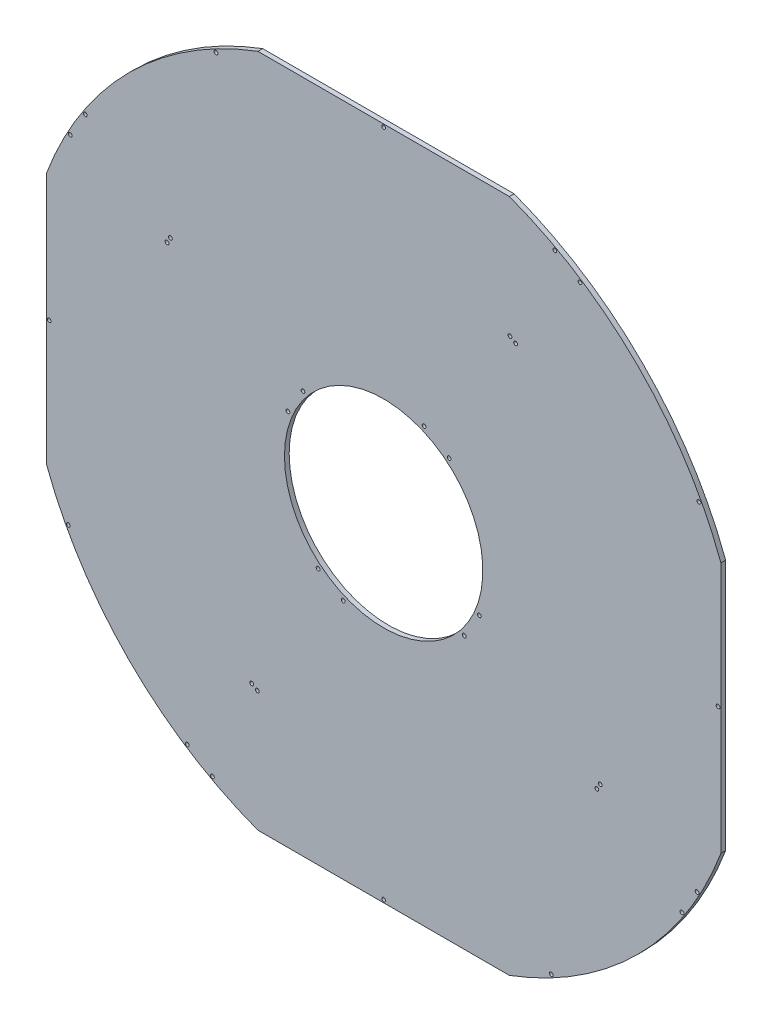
ISO-10303-21;
HEADER;
FILE_DESCRIPTION(('STEP AP214'),'2;1');
FILE_NAME('part.step','',(''),(''),'','','');
FILE_SCHEMA(('AUTOMOTIVE_DESIGN { 1 0 10303 214 1 1 1 1 }'));
ENDSEC;
DATA;
#1=APPLICATION_CONTEXT('core data for automotive mechanical design processes');
#2=APPLICATION_PROTOCOL_DEFINITION('international standard','automotive_design',2000,#1);
#3=PRODUCT_CONTEXT('',#1,'mechanical');
#4=PRODUCT('Part','Part','',(#3));
#5=PRODUCT_RELATED_PRODUCT_CATEGORY('part','',(#4));
#6=PRODUCT_DEFINITION_FORMATION('','',#4);
#7=PRODUCT_DEFINITION_CONTEXT('part definition',#1,'design');
#8=PRODUCT_DEFINITION('design','',#6,#7);
#9=PRODUCT_DEFINITION_SHAPE('','',#8);
#10=(LENGTH_UNIT() NAMED_UNIT(*) SI_UNIT(.MILLI.,.METRE.));
#11=(NAMED_UNIT(*) PLANE_ANGLE_UNIT() SI_UNIT($,.RADIAN.));
#12=(NAMED_UNIT(*) SI_UNIT($,.STERADIAN.) SOLID_ANGLE_UNIT());
#13=UNCERTAINTY_MEASURE_WITH_UNIT(LENGTH_MEASURE(1.E-05),#10,'distance_accuracy_value','');
#14=(GEOMETRIC_REPRESENTATION_CONTEXT(3) GLOBAL_UNCERTAINTY_ASSIGNED_CONTEXT((#13)) GLOBAL_UNIT_ASSIGNED_CONTEXT((#10,
#11,#12)) REPRESENTATION_CONTEXT('',''));
#15=CARTESIAN_POINT('',(0.,0.,0.));
#16=DIRECTION('',(0.,0.,1.));
#17=DIRECTION('',(1.,0.,0.));
#18=AXIS2_PLACEMENT_3D('',#15,#16,#17);
#19=CARTESIAN_POINT('',(0.,0.,5.));
#20=DIRECTION('',(0.,0.,-1.));
#21=DIRECTION('',(-1.,0.,0.));
#22=AXIS2_PLACEMENT_3D('',#19,#20,#21);
#23=CYLINDRICAL_SURFACE('',#22,381.);
#24=CARTESIAN_POINT('',(0.,0.,0.));
#25=DIRECTION('',(0.,0.,1.));
#26=DIRECTION('',(-1.,0.,0.));
#27=AXIS2_PLACEMENT_3D('',#24,#25,#26);
#28=CIRCLE('',#27,381.);
#29=CARTESIAN_POINT('',(357.000000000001,133.086438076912,0.));
#30=VERTEX_POINT('',#29);
#31=CARTESIAN_POINT('',(133.086438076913,357.,0.));
#32=VERTEX_POINT('',#31);
#33=EDGE_CURVE('E75',#30,#32,#28,.T.);
#34=ORIENTED_EDGE('',*,*,#33,.T.);
#35=DIRECTION('',(0.,0.,-1.));
#36=VECTOR('',#35,1.);
#37=CARTESIAN_POINT('',(133.086438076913,357.,5.));
#38=LINE('',#37,#36);
#39=CARTESIAN_POINT('',(133.086438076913,357.,5.));
#40=VERTEX_POINT('',#39);
#41=EDGE_CURVE('E11',#40,#32,#38,.T.);
#42=ORIENTED_EDGE('',*,*,#41,.F.);
#43=CARTESIAN_POINT('',(0.,0.,5.));
#44=DIRECTION('',(0.,0.,1.));
#45=DIRECTION('',(-1.,0.,0.));
#46=AXIS2_PLACEMENT_3D('',#43,#44,#45);
#47=CIRCLE('',#46,381.);
#48=CARTESIAN_POINT('',(357.000000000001,133.086438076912,5.));
#49=VERTEX_POINT('',#48);
#50=EDGE_CURVE('E64',#49,#40,#47,.T.);
#51=ORIENTED_EDGE('',*,*,#50,.F.);
#52=DIRECTION('',(0.,0.,-1.));
#53=VECTOR('',#52,1.);
#54=CARTESIAN_POINT('',(357.000000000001,133.086438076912,5.));
#55=LINE('',#54,#53);
#56=EDGE_CURVE('E87',#49,#30,#55,.T.);
#57=ORIENTED_EDGE('',*,*,#56,.T.);
#58=EDGE_LOOP('',(#34,#42,#51,#57));
#59=FACE_BOUND('',#58,.T.);
#60=ADVANCED_FACE('F30',(#59),#23,.T.);
#61=CARTESIAN_POINT('',(133.086438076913,357.,5.));
#62=DIRECTION('',(0.,-1.,0.));
#63=DIRECTION('',(0.,0.,-1.));
#64=AXIS2_PLACEMENT_3D('',#61,#62,#63);
#65=PLANE('',#64);
#66=DIRECTION('',(-1.,0.,0.));
#67=VECTOR('',#66,1.);
#68=CARTESIAN_POINT('',(133.086438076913,357.,0.));
#69=LINE('',#68,#67);
#70=CARTESIAN_POINT('',(-133.086438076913,357.,0.));
#71=VERTEX_POINT('',#70);
#72=EDGE_CURVE('E57',#32,#71,#69,.T.);
#73=ORIENTED_EDGE('',*,*,#72,.T.);
#74=DIRECTION('',(0.,0.,-1.));
#75=VECTOR('',#74,1.);
#76=CARTESIAN_POINT('',(-133.086438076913,357.,5.));
#77=LINE('',#76,#75);
#78=CARTESIAN_POINT('',(-133.086438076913,357.,5.));
#79=VERTEX_POINT('',#78);
#80=EDGE_CURVE('E38',#79,#71,#77,.T.);
#81=ORIENTED_EDGE('',*,*,#80,.F.);
#82=DIRECTION('',(-1.,0.,0.));
#83=VECTOR('',#82,1.);
#84=CARTESIAN_POINT('',(133.086438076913,357.,5.));
#85=LINE('',#84,#83);
#86=EDGE_CURVE('E46',#40,#79,#85,.T.);
#87=ORIENTED_EDGE('',*,*,#86,.F.);
#88=ORIENTED_EDGE('',*,*,#41,.T.);
#89=EDGE_LOOP('',(#73,#81,#87,#88));
#90=FACE_BOUND('',#89,.T.);
#91=ADVANCED_FACE('F452',(#90),#65,.F.);
#92=CARTESIAN_POINT('',(0.,0.,5.));
#93=DIRECTION('',(0.,0.,-1.));
#94=DIRECTION('',(-1.,0.,0.));
#95=AXIS2_PLACEMENT_3D('',#92,#93,#94);
#96=CYLINDRICAL_SURFACE('',#95,381.);
#97=CARTESIAN_POINT('',(0.,0.,0.));
#98=DIRECTION('',(0.,0.,1.));
#99=DIRECTION('',(-1.,0.,0.));
#100=AXIS2_PLACEMENT_3D('',#97,#98,#99);
#101=CIRCLE('',#100,381.);
#102=CARTESIAN_POINT('',(-356.999999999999,133.086438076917,0.));
#103=VERTEX_POINT('',#102);
#104=EDGE_CURVE('E156',#71,#103,#101,.T.);
#105=ORIENTED_EDGE('',*,*,#104,.T.);
#106=DIRECTION('',(0.,0.,-1.));
#107=VECTOR('',#106,1.);
#108=CARTESIAN_POINT('',(-356.999999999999,133.086438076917,5.));
#109=LINE('',#108,#107);
#110=CARTESIAN_POINT('',(-356.999999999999,133.086438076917,5.));
#111=VERTEX_POINT('',#110);
#112=EDGE_CURVE('E184',#111,#103,#109,.T.);
#113=ORIENTED_EDGE('',*,*,#112,.F.);
#114=CARTESIAN_POINT('',(0.,0.,5.));
#115=DIRECTION('',(0.,0.,1.));
#116=DIRECTION('',(-1.,0.,0.));
#117=AXIS2_PLACEMENT_3D('',#114,#115,#116);
#118=CIRCLE('',#117,381.);
#119=EDGE_CURVE('E150',#79,#111,#118,.T.);
#120=ORIENTED_EDGE('',*,*,#119,.F.);
#121=ORIENTED_EDGE('',*,*,#80,.T.);
#122=EDGE_LOOP('',(#105,#113,#120,#121));
#123=FACE_BOUND('',#122,.T.);
#124=ADVANCED_FACE('F163',(#123),#96,.T.);
#125=CARTESIAN_POINT('',(0.,0.,5.));
#126=DIRECTION('',(0.,0.,-1.));
#127=DIRECTION('',(-1.,0.,0.));
#128=AXIS2_PLACEMENT_3D('',#125,#126,#127);
#129=CYLINDRICAL_SURFACE('',#128,105.);
#130=CARTESIAN_POINT('',(0.,0.,0.));
#131=DIRECTION('',(0.,0.,-1.));
#132=DIRECTION('',(-1.,0.,0.));
#133=AXIS2_PLACEMENT_3D('',#130,#131,#132);
#134=CIRCLE('',#133,105.);
#135=CARTESIAN_POINT('',(-105.,0.,0.));
#136=VERTEX_POINT('',#135);
#137=EDGE_CURVE('E148',#136,#136,#134,.T.);
#138=ORIENTED_EDGE('',*,*,#137,.T.);
#139=EDGE_LOOP('',(#138));
#140=FACE_BOUND('',#139,.T.);
#141=CARTESIAN_POINT('',(0.,0.,5.));
#142=DIRECTION('',(0.,0.,-1.));
#143=DIRECTION('',(-1.,0.,0.));
#144=AXIS2_PLACEMENT_3D('',#141,#142,#143);
#145=CIRCLE('',#144,105.);
#146=CARTESIAN_POINT('',(-105.,0.,5.));
#147=VERTEX_POINT('',#146);
#148=EDGE_CURVE('E152',#147,#147,#145,.T.);
#149=ORIENTED_EDGE('',*,*,#148,.F.);
#150=EDGE_LOOP('',(#149));
#151=FACE_BOUND('',#150,.T.);
#152=ADVANCED_FACE('F389',(#140,#151),#129,.F.);
#153=CARTESIAN_POINT('',(0.,0.,5.));
#154=DIRECTION('',(0.,0.,-1.));
#155=DIRECTION('',(-1.,0.,0.));
#156=AXIS2_PLACEMENT_3D('',#153,#154,#155);
#157=PLANE('',#156);
#158=CARTESIAN_POINT('',(-139.694756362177,-225.695502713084,5.));
#159=DIRECTION('',(0.,0.,1.));
#160=DIRECTION('',(0.,1.,0.));
#161=AXIS2_PLACEMENT_3D('',#158,#159,#160);
#162=CIRCLE('',#161,1.99999999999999);
#163=CARTESIAN_POINT('',(-139.694756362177,-223.695502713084,5.));
#164=VERTEX_POINT('',#163);
#165=EDGE_CURVE('E372',#164,#164,#162,.T.);
#166=ORIENTED_EDGE('',*,*,#165,.F.);
#167=EDGE_LOOP('',(#166));
#168=FACE_BOUND('',#167,.T.);
#169=CARTESIAN_POINT('',(-229.300769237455,133.694585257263,5.));
#170=DIRECTION('',(0.,0.,1.));
#171=DIRECTION('',(0.,1.,0.));
#172=AXIS2_PLACEMENT_3D('',#169,#170,#171);
#173=CIRCLE('',#172,2.00000000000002);
#174=CARTESIAN_POINT('',(-229.300769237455,135.694585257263,5.));
#175=VERTEX_POINT('',#174);
#176=EDGE_CURVE('E366',#175,#175,#173,.T.);
#177=ORIENTED_EDGE('',*,*,#176,.F.);
#178=EDGE_LOOP('',(#177));
#179=FACE_BOUND('',#178,.T.);
#180=CARTESIAN_POINT('',(-331.719815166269,181.23455582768,5.));
#181=DIRECTION('',(0.,0.,1.));
#182=DIRECTION('',(0.,1.,0.));
#183=AXIS2_PLACEMENT_3D('',#180,#181,#182);
#184=CIRCLE('',#183,2.);
#185=CARTESIAN_POINT('',(-331.719815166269,183.23455582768,5.));
#186=VERTEX_POINT('',#185);
#187=EDGE_CURVE('E360',#186,#186,#184,.T.);
#188=ORIENTED_EDGE('',*,*,#187,.F.);
#189=EDGE_LOOP('',(#188));
#190=FACE_BOUND('',#189,.T.);
#191=CARTESIAN_POINT('',(-101.330734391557,42.8028301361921,5.));
#192=DIRECTION('',(0.,0.,1.));
#193=DIRECTION('',(0.,1.,0.));
#194=AXIS2_PLACEMENT_3D('',#191,#192,#193);
#195=CIRCLE('',#194,2.00000000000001);
#196=CARTESIAN_POINT('',(-101.330734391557,44.8028301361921,5.));
#197=VERTEX_POINT('',#196);
#198=EDGE_CURVE('E354',#197,#197,#195,.T.);
#199=ORIENTED_EDGE('',*,*,#198,.F.);
#200=EDGE_LOOP('',(#199));
#201=FACE_BOUND('',#200,.T.);
#202=CARTESIAN_POINT('',(-354.,3.69407539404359E-12,5.));
#203=DIRECTION('',(0.,0.,1.));
#204=DIRECTION('',(0.,1.,0.));
#205=AXIS2_PLACEMENT_3D('',#202,#203,#204);
#206=CIRCLE('',#205,1.99999999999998);
#207=CARTESIAN_POINT('',(-354.,2.00000000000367,5.));
#208=VERTEX_POINT('',#207);
#209=EDGE_CURVE('E348',#208,#208,#206,.T.);
#210=ORIENTED_EDGE('',*,*,#209,.F.);
#211=EDGE_LOOP('',(#210));
#212=FACE_BOUND('',#211,.T.);
#213=CARTESIAN_POINT('',(-69.3750164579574,-85.3645540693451,5.));
#214=DIRECTION('',(0.,0.,1.));
#215=DIRECTION('',(0.,1.,0.));
#216=AXIS2_PLACEMENT_3D('',#213,#214,#215);
#217=CIRCLE('',#216,2.);
#218=CARTESIAN_POINT('',(-69.3750164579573,-83.3645540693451,5.));
#219=VERTEX_POINT('',#218);
#220=EDGE_CURVE('E342',#219,#219,#217,.T.);
#221=ORIENTED_EDGE('',*,*,#220,.F.);
#222=EDGE_LOOP('',(#221));
#223=FACE_BOUND('',#222,.T.);
#224=CARTESIAN_POINT('',(-333.754190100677,-177.460250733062,5.));
#225=DIRECTION('',(0.,0.,1.));
#226=DIRECTION('',(0.,1.,0.));
#227=AXIS2_PLACEMENT_3D('',#224,#225,#226);
#228=CIRCLE('',#227,2.00000000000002);
#229=CARTESIAN_POINT('',(-333.754190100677,-175.460250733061,5.));
#230=VERTEX_POINT('',#229);
#231=EDGE_CURVE('E336',#230,#230,#228,.T.);
#232=ORIENTED_EDGE('',*,*,#231,.F.);
#233=EDGE_LOOP('',(#232));
#234=FACE_BOUND('',#233,.T.);
#235=CARTESIAN_POINT('',(-207.806742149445,-315.753634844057,5.));
#236=DIRECTION('',(0.,0.,1.));
#237=DIRECTION('',(0.,1.,0.));
#238=AXIS2_PLACEMENT_3D('',#235,#236,#237);
#239=CIRCLE('',#238,2.00000000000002);
#240=CARTESIAN_POINT('',(-207.806742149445,-313.753634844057,5.));
#241=VERTEX_POINT('',#240);
#242=EDGE_CURVE('E330',#241,#241,#239,.T.);
#243=ORIENTED_EDGE('',*,*,#242,.F.);
#244=EDGE_LOOP('',(#243));
#245=FACE_BOUND('',#244,.T.);
#246=CARTESIAN_POINT('',(225.695502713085,-139.694756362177,5.));
#247=DIRECTION('',(0.,0.,1.));
#248=DIRECTION('',(-1.,0.,0.));
#249=AXIS2_PLACEMENT_3D('',#246,#247,#248);
#250=CIRCLE('',#249,1.99999999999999);
#251=CARTESIAN_POINT('',(223.695502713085,-139.694756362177,5.));
#252=VERTEX_POINT('',#251);
#253=EDGE_CURVE('E324',#252,#252,#250,.T.);
#254=ORIENTED_EDGE('',*,*,#253,.F.);
#255=EDGE_LOOP('',(#254));
#256=FACE_BOUND('',#255,.T.);
#257=CARTESIAN_POINT('',(-133.694585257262,-229.300769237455,5.));
#258=DIRECTION('',(0.,0.,1.));
#259=DIRECTION('',(-1.,0.,0.));
#260=AXIS2_PLACEMENT_3D('',#257,#258,#259);
#261=CIRCLE('',#260,2.00000000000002);
#262=CARTESIAN_POINT('',(-135.694585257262,-229.300769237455,5.));
#263=VERTEX_POINT('',#262);
#264=EDGE_CURVE('E318',#263,#263,#261,.T.);
#265=ORIENTED_EDGE('',*,*,#264,.F.);
#266=EDGE_LOOP('',(#265));
#267=FACE_BOUND('',#266,.T.);
#268=CARTESIAN_POINT('',(-181.234555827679,-331.71981516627,5.));
#269=DIRECTION('',(0.,0.,1.));
#270=DIRECTION('',(-1.,0.,0.));
#271=AXIS2_PLACEMENT_3D('',#268,#269,#270);
#272=CIRCLE('',#271,2.);
#273=CARTESIAN_POINT('',(-183.234555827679,-331.71981516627,5.));
#274=VERTEX_POINT('',#273);
#275=EDGE_CURVE('E312',#274,#274,#272,.T.);
#276=ORIENTED_EDGE('',*,*,#275,.F.);
#277=EDGE_LOOP('',(#276));
#278=FACE_BOUND('',#277,.T.);
#279=CARTESIAN_POINT('',(-42.8028301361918,-101.330734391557,5.));
#280=DIRECTION('',(0.,0.,1.));
#281=DIRECTION('',(-1.,0.,0.));
#282=AXIS2_PLACEMENT_3D('',#279,#280,#281);
#283=CIRCLE('',#282,2.00000000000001);
#284=CARTESIAN_POINT('',(-44.8028301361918,-101.330734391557,5.));
#285=VERTEX_POINT('',#284);
#286=EDGE_CURVE('E306',#285,#285,#283,.T.);
#287=ORIENTED_EDGE('',*,*,#286,.F.);
#288=EDGE_LOOP('',(#287));
#289=FACE_BOUND('',#288,.T.);
#290=CARTESIAN_POINT('',(-2.45809100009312E-12,-354.,5.));
#291=DIRECTION('',(0.,0.,1.));
#292=DIRECTION('',(-1.,0.,0.));
#293=AXIS2_PLACEMENT_3D('',#290,#291,#292);
#294=CIRCLE('',#293,1.99999999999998);
#295=CARTESIAN_POINT('',(-2.00000000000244,-354.,5.));
#296=VERTEX_POINT('',#295);
#297=EDGE_CURVE('E300',#296,#296,#294,.T.);
#298=ORIENTED_EDGE('',*,*,#297,.F.);
#299=EDGE_LOOP('',(#298));
#300=FACE_BOUND('',#299,.T.);
#301=CARTESIAN_POINT('',(85.3645540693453,-69.3750164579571,5.));
#302=DIRECTION('',(0.,0.,1.));
#303=DIRECTION('',(-1.,0.,0.));
#304=AXIS2_PLACEMENT_3D('',#301,#302,#303);
#305=CIRCLE('',#304,2.);
#306=CARTESIAN_POINT('',(83.3645540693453,-69.3750164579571,5.));
#307=VERTEX_POINT('',#306);
#308=EDGE_CURVE('E294',#307,#307,#305,.T.);
#309=ORIENTED_EDGE('',*,*,#308,.F.);
#310=EDGE_LOOP('',(#309));
#311=FACE_BOUND('',#310,.T.);
#312=CARTESIAN_POINT('',(177.460250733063,-333.754190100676,5.));
#313=DIRECTION('',(0.,0.,1.));
#314=DIRECTION('',(-1.,0.,0.));
#315=AXIS2_PLACEMENT_3D('',#312,#313,#314);
#316=CIRCLE('',#315,2.00000000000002);
#317=CARTESIAN_POINT('',(175.460250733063,-333.754190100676,5.));
#318=VERTEX_POINT('',#317);
#319=EDGE_CURVE('E288',#318,#318,#316,.T.);
#320=ORIENTED_EDGE('',*,*,#319,.F.);
#321=EDGE_LOOP('',(#320));
#322=FACE_BOUND('',#321,.T.);
#323=CARTESIAN_POINT('',(315.753634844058,-207.806742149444,5.));
#324=DIRECTION('',(0.,0.,1.));
#325=DIRECTION('',(-1.,0.,0.));
#326=AXIS2_PLACEMENT_3D('',#323,#324,#325);
#327=CIRCLE('',#326,2.00000000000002);
#328=CARTESIAN_POINT('',(313.753634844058,-207.806742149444,5.));
#329=VERTEX_POINT('',#328);
#330=EDGE_CURVE('E282',#329,#329,#327,.T.);
#331=ORIENTED_EDGE('',*,*,#330,.F.);
#332=EDGE_LOOP('',(#331));
#333=FACE_BOUND('',#332,.T.);
#334=CARTESIAN_POINT('',(139.694756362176,225.695502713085,5.));
#335=DIRECTION('',(0.,0.,1.));
#336=DIRECTION('',(0.,-1.,0.));
#337=AXIS2_PLACEMENT_3D('',#334,#335,#336);
#338=CIRCLE('',#337,1.99999999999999);
#339=CARTESIAN_POINT('',(139.694756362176,223.695502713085,5.));
#340=VERTEX_POINT('',#339);
#341=EDGE_CURVE('E276',#340,#340,#338,.T.);
#342=ORIENTED_EDGE('',*,*,#341,.F.);
#343=EDGE_LOOP('',(#342));
#344=FACE_BOUND('',#343,.T.);
#345=CARTESIAN_POINT('',(229.300769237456,-133.694585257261,5.));
#346=DIRECTION('',(0.,0.,1.));
#347=DIRECTION('',(0.,-1.,0.));
#348=AXIS2_PLACEMENT_3D('',#345,#346,#347);
#349=CIRCLE('',#348,2.00000000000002);
#350=CARTESIAN_POINT('',(229.300769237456,-135.694585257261,5.));
#351=VERTEX_POINT('',#350);
#352=EDGE_CURVE('E270',#351,#351,#349,.T.);
#353=ORIENTED_EDGE('',*,*,#352,.F.);
#354=EDGE_LOOP('',(#353));
#355=FACE_BOUND('',#354,.T.);
#356=CARTESIAN_POINT('',(331.71981516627,-181.234555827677,5.));
#357=DIRECTION('',(0.,0.,1.));
#358=DIRECTION('',(0.,-1.,0.));
#359=AXIS2_PLACEMENT_3D('',#356,#357,#358);
#360=CIRCLE('',#359,2.);
#361=CARTESIAN_POINT('',(331.71981516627,-183.234555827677,5.));
#362=VERTEX_POINT('',#361);
#363=EDGE_CURVE('E264',#362,#362,#360,.T.);
#364=ORIENTED_EDGE('',*,*,#363,.F.);
#365=EDGE_LOOP('',(#364));
#366=FACE_BOUND('',#365,.T.);
#367=CARTESIAN_POINT('',(101.330734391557,-42.8028301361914,5.));
#368=DIRECTION('',(0.,0.,1.));
#369=DIRECTION('',(0.,-1.,0.));
#370=AXIS2_PLACEMENT_3D('',#367,#368,#369);
#371=CIRCLE('',#370,2.00000000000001);
#372=CARTESIAN_POINT('',(101.330734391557,-44.8028301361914,5.));
#373=VERTEX_POINT('',#372);
#374=EDGE_CURVE('E258',#373,#373,#371,.T.);
#375=ORIENTED_EDGE('',*,*,#374,.F.);
#376=EDGE_LOOP('',(#375));
#377=FACE_BOUND('',#376,.T.);
#378=CARTESIAN_POINT('',(354.,-1.22210660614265E-12,5.));
#379=DIRECTION('',(0.,0.,1.));
#380=DIRECTION('',(0.,-1.,0.));
#381=AXIS2_PLACEMENT_3D('',#378,#379,#380);
#382=CIRCLE('',#381,1.99999999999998);
#383=CARTESIAN_POINT('',(354.,-2.0000000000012,5.));
#384=VERTEX_POINT('',#383);
#385=EDGE_CURVE('E252',#384,#384,#382,.T.);
#386=ORIENTED_EDGE('',*,*,#385,.F.);
#387=EDGE_LOOP('',(#386));
#388=FACE_BOUND('',#387,.T.);
#389=CARTESIAN_POINT('',(69.3750164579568,85.3645540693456,5.));
#390=DIRECTION('',(0.,0.,1.));
#391=DIRECTION('',(0.,-1.,0.));
#392=AXIS2_PLACEMENT_3D('',#389,#390,#391);
#393=CIRCLE('',#392,2.);
#394=CARTESIAN_POINT('',(69.3750164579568,83.3645540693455,5.));
#395=VERTEX_POINT('',#394);
#396=EDGE_CURVE('E246',#395,#395,#393,.T.);
#397=ORIENTED_EDGE('',*,*,#396,.F.);
#398=EDGE_LOOP('',(#397));
#399=FACE_BOUND('',#398,.T.);
#400=CARTESIAN_POINT('',(333.754190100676,177.460250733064,5.));
#401=DIRECTION('',(0.,0.,1.));
#402=DIRECTION('',(0.,-1.,0.));
#403=AXIS2_PLACEMENT_3D('',#400,#401,#402);
#404=CIRCLE('',#403,2.00000000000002);
#405=CARTESIAN_POINT('',(333.754190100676,175.460250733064,5.));
#406=VERTEX_POINT('',#405);
#407=EDGE_CURVE('E240',#406,#406,#404,.T.);
#408=ORIENTED_EDGE('',*,*,#407,.F.);
#409=EDGE_LOOP('',(#408));
#410=FACE_BOUND('',#409,.T.);
#411=CARTESIAN_POINT('',(207.806742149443,315.753634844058,5.));
#412=DIRECTION('',(0.,0.,1.));
#413=DIRECTION('',(0.,-1.,0.));
#414=AXIS2_PLACEMENT_3D('',#411,#412,#413);
#415=CIRCLE('',#414,2.00000000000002);
#416=CARTESIAN_POINT('',(207.806742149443,313.753634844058,5.));
#417=VERTEX_POINT('',#416);
#418=EDGE_CURVE('E234',#417,#417,#415,.T.);
#419=ORIENTED_EDGE('',*,*,#418,.F.);
#420=EDGE_LOOP('',(#419));
#421=FACE_BOUND('',#420,.T.);
#422=DIRECTION('',(0.,1.,0.));
#423=VECTOR('',#422,1.);
#424=CARTESIAN_POINT('',(357.,-133.086438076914,5.));
#425=LINE('',#424,#423);
#426=CARTESIAN_POINT('',(357.,-133.086438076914,5.));
#427=VERTEX_POINT('',#426);
#428=EDGE_CURVE('E94',#427,#49,#425,.T.);
#429=ORIENTED_EDGE('',*,*,#428,.T.);
#430=ORIENTED_EDGE('',*,*,#50,.T.);
#431=ORIENTED_EDGE('',*,*,#86,.T.);
#432=ORIENTED_EDGE('',*,*,#119,.T.);
#433=DIRECTION('',(0.,-1.,0.));
#434=VECTOR('',#433,1.);
#435=CARTESIAN_POINT('',(-356.999999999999,133.086438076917,5.));
#436=LINE('',#435,#434);
#437=CARTESIAN_POINT('',(-357.000000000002,-133.086438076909,5.));
#438=VERTEX_POINT('',#437);
#439=EDGE_CURVE('E180',#111,#438,#436,.T.);
#440=ORIENTED_EDGE('',*,*,#439,.T.);
#441=CARTESIAN_POINT('',(0.,0.,5.));
#442=DIRECTION('',(0.,0.,1.));
#443=DIRECTION('',(1.,0.,0.));
#444=AXIS2_PLACEMENT_3D('',#441,#442,#443);
#445=CIRCLE('',#444,381.);
#446=CARTESIAN_POINT('',(-133.086438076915,-356.999999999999,5.));
#447=VERTEX_POINT('',#446);
#448=EDGE_CURVE('E194',#438,#447,#445,.T.);
#449=ORIENTED_EDGE('',*,*,#448,.T.);
#450=DIRECTION('',(1.,0.,0.));
#451=VECTOR('',#450,1.);
#452=CARTESIAN_POINT('',(-133.086438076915,-356.999999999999,5.));
#453=LINE('',#452,#451);
#454=CARTESIAN_POINT('',(133.086438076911,-357.000000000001,5.));
#455=VERTEX_POINT('',#454);
#456=EDGE_CURVE('E197',#447,#455,#453,.T.);
#457=ORIENTED_EDGE('',*,*,#456,.T.);
#458=CARTESIAN_POINT('',(0.,0.,5.));
#459=DIRECTION('',(0.,0.,1.));
#460=DIRECTION('',(0.,1.,0.));
#461=AXIS2_PLACEMENT_3D('',#458,#459,#460);
#462=CIRCLE('',#461,381.);
#463=EDGE_CURVE('E91',#455,#427,#462,.T.);
#464=ORIENTED_EDGE('',*,*,#463,.T.);
#465=EDGE_LOOP('',(#429,#430,#431,#432,#440,#449,#457,#464));
#466=FACE_BOUND('',#465,.T.);
#467=CARTESIAN_POINT('',(-225.695502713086,139.694756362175,5.));
#468=DIRECTION('',(0.,0.,1.));
#469=DIRECTION('',(1.,0.,0.));
#470=AXIS2_PLACEMENT_3D('',#467,#468,#469);
#471=CIRCLE('',#470,1.99999999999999);
#472=CARTESIAN_POINT('',(-223.695502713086,139.694756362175,5.));
#473=VERTEX_POINT('',#472);
#474=EDGE_CURVE('E96',#473,#473,#471,.T.);
#475=ORIENTED_EDGE('',*,*,#474,.F.);
#476=EDGE_LOOP('',(#475));
#477=FACE_BOUND('',#476,.T.);
#478=CARTESIAN_POINT('',(133.69458525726,229.300769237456,5.));
#479=DIRECTION('',(0.,0.,1.));
#480=DIRECTION('',(1.,0.,0.));
#481=AXIS2_PLACEMENT_3D('',#478,#479,#480);
#482=CIRCLE('',#481,2.00000000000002);
#483=CARTESIAN_POINT('',(135.69458525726,229.300769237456,5.));
#484=VERTEX_POINT('',#483);
#485=EDGE_CURVE('E104',#484,#484,#482,.T.);
#486=ORIENTED_EDGE('',*,*,#485,.F.);
#487=EDGE_LOOP('',(#486));
#488=FACE_BOUND('',#487,.T.);
#489=CARTESIAN_POINT('',(181.234555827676,331.719815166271,5.));
#490=DIRECTION('',(0.,0.,1.));
#491=DIRECTION('',(1.,0.,0.));
#492=AXIS2_PLACEMENT_3D('',#489,#490,#491);
#493=CIRCLE('',#492,2.);
#494=CARTESIAN_POINT('',(183.234555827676,331.719815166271,5.));
#495=VERTEX_POINT('',#494);
#496=EDGE_CURVE('E110',#495,#495,#493,.T.);
#497=ORIENTED_EDGE('',*,*,#496,.F.);
#498=EDGE_LOOP('',(#497));
#499=FACE_BOUND('',#498,.T.);
#500=CARTESIAN_POINT('',(42.8028301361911,101.330734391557,5.));
#501=DIRECTION('',(0.,0.,1.));
#502=DIRECTION('',(1.,0.,0.));
#503=AXIS2_PLACEMENT_3D('',#500,#501,#502);
#504=CIRCLE('',#503,2.00000000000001);
#505=CARTESIAN_POINT('',(44.8028301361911,101.330734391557,5.));
#506=VERTEX_POINT('',#505);
#507=EDGE_CURVE('E116',#506,#506,#504,.T.);
#508=ORIENTED_EDGE('',*,*,#507,.F.);
#509=EDGE_LOOP('',(#508));
#510=FACE_BOUND('',#509,.T.);
#511=CARTESIAN_POINT('',(0.,354.,5.));
#512=DIRECTION('',(0.,0.,1.));
#513=DIRECTION('',(1.,0.,0.));
#514=AXIS2_PLACEMENT_3D('',#511,#512,#513);
#515=CIRCLE('',#514,1.99999999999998);
#516=CARTESIAN_POINT('',(1.99999999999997,354.,5.));
#517=VERTEX_POINT('',#516);
#518=EDGE_CURVE('E122',#517,#517,#515,.T.);
#519=ORIENTED_EDGE('',*,*,#518,.F.);
#520=EDGE_LOOP('',(#519));
#521=FACE_BOUND('',#520,.T.);
#522=CARTESIAN_POINT('',(-85.3645540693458,69.3750164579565,5.));
#523=DIRECTION('',(0.,0.,1.));
#524=DIRECTION('',(1.,0.,0.));
#525=AXIS2_PLACEMENT_3D('',#522,#523,#524);
#526=CIRCLE('',#525,2.);
#527=CARTESIAN_POINT('',(-83.3645540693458,69.3750164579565,5.));
#528=VERTEX_POINT('',#527);
#529=EDGE_CURVE('E128',#528,#528,#526,.T.);
#530=ORIENTED_EDGE('',*,*,#529,.F.);
#531=EDGE_LOOP('',(#530));
#532=FACE_BOUND('',#531,.T.);
#533=CARTESIAN_POINT('',(-177.460250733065,333.754190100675,5.));
#534=DIRECTION('',(0.,0.,1.));
#535=DIRECTION('',(1.,0.,0.));
#536=AXIS2_PLACEMENT_3D('',#533,#534,#535);
#537=CIRCLE('',#536,2.00000000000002);
#538=CARTESIAN_POINT('',(-175.460250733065,333.754190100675,5.));
#539=VERTEX_POINT('',#538);
#540=EDGE_CURVE('E134',#539,#539,#537,.T.);
#541=ORIENTED_EDGE('',*,*,#540,.F.);
#542=EDGE_LOOP('',(#541));
#543=FACE_BOUND('',#542,.T.);
#544=CARTESIAN_POINT('',(-315.753634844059,207.806742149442,5.));
#545=DIRECTION('',(0.,0.,1.));
#546=DIRECTION('',(1.,0.,0.));
#547=AXIS2_PLACEMENT_3D('',#544,#545,#546);
#548=CIRCLE('',#547,2.00000000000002);
#549=CARTESIAN_POINT('',(-313.753634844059,207.806742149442,5.));
#550=VERTEX_POINT('',#549);
#551=EDGE_CURVE('E140',#550,#550,#548,.T.);
#552=ORIENTED_EDGE('',*,*,#551,.F.);
#553=EDGE_LOOP('',(#552));
#554=FACE_BOUND('',#553,.T.);
#555=ORIENTED_EDGE('',*,*,#148,.T.);
#556=EDGE_LOOP('',(#555));
#557=FACE_BOUND('',#556,.T.);
#558=ADVANCED_FACE('F230',(#168,#179,#190,#201,#212,#223,#234,#245,#256,#267,#278,#289,#300,
#311,#322,#333,#344,#355,#366,#377,#388,#399,#410,#421,#466,#477,#488,#499,#510,#521,#532,#543,
#554,#557),#157,.F.);
#559=CARTESIAN_POINT('',(0.,0.,0.));
#560=DIRECTION('',(0.,0.,-1.));
#561=DIRECTION('',(-1.,0.,0.));
#562=AXIS2_PLACEMENT_3D('',#559,#560,#561);
#563=PLANE('',#562);
#564=CARTESIAN_POINT('',(-139.694756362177,-225.695502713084,0.));
#565=DIRECTION('',(0.,0.,1.));
#566=DIRECTION('',(0.,1.,0.));
#567=AXIS2_PLACEMENT_3D('',#564,#565,#566);
#568=CIRCLE('',#567,1.99999999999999);
#569=CARTESIAN_POINT('',(-139.694756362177,-223.695502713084,0.));
#570=VERTEX_POINT('',#569);
#571=EDGE_CURVE('E369',#570,#570,#568,.T.);
#572=ORIENTED_EDGE('',*,*,#571,.T.);
#573=EDGE_LOOP('',(#572));
#574=FACE_BOUND('',#573,.T.);
#575=CARTESIAN_POINT('',(-229.300769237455,133.694585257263,0.));
#576=DIRECTION('',(0.,0.,1.));
#577=DIRECTION('',(0.,1.,0.));
#578=AXIS2_PLACEMENT_3D('',#575,#576,#577);
#579=CIRCLE('',#578,2.00000000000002);
#580=CARTESIAN_POINT('',(-229.300769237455,135.694585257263,0.));
#581=VERTEX_POINT('',#580);
#582=EDGE_CURVE('E363',#581,#581,#579,.T.);
#583=ORIENTED_EDGE('',*,*,#582,.T.);
#584=EDGE_LOOP('',(#583));
#585=FACE_BOUND('',#584,.T.);
#586=CARTESIAN_POINT('',(-331.719815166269,181.23455582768,0.));
#587=DIRECTION('',(0.,0.,1.));
#588=DIRECTION('',(0.,1.,0.));
#589=AXIS2_PLACEMENT_3D('',#586,#587,#588);
#590=CIRCLE('',#589,2.);
#591=CARTESIAN_POINT('',(-331.719815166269,183.23455582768,0.));
#592=VERTEX_POINT('',#591);
#593=EDGE_CURVE('E357',#592,#592,#590,.T.);
#594=ORIENTED_EDGE('',*,*,#593,.T.);
#595=EDGE_LOOP('',(#594));
#596=FACE_BOUND('',#595,.T.);
#597=CARTESIAN_POINT('',(-101.330734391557,42.8028301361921,0.));
#598=DIRECTION('',(0.,0.,1.));
#599=DIRECTION('',(0.,1.,0.));
#600=AXIS2_PLACEMENT_3D('',#597,#598,#599);
#601=CIRCLE('',#600,2.00000000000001);
#602=CARTESIAN_POINT('',(-101.330734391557,44.8028301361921,0.));
#603=VERTEX_POINT('',#602);
#604=EDGE_CURVE('E351',#603,#603,#601,.T.);
#605=ORIENTED_EDGE('',*,*,#604,.T.);
#606=EDGE_LOOP('',(#605));
#607=FACE_BOUND('',#606,.T.);
#608=CARTESIAN_POINT('',(-354.,3.69407539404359E-12,0.));
#609=DIRECTION('',(0.,0.,1.));
#610=DIRECTION('',(0.,1.,0.));
#611=AXIS2_PLACEMENT_3D('',#608,#609,#610);
#612=CIRCLE('',#611,1.99999999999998);
#613=CARTESIAN_POINT('',(-354.,2.00000000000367,0.));
#614=VERTEX_POINT('',#613);
#615=EDGE_CURVE('E345',#614,#614,#612,.T.);
#616=ORIENTED_EDGE('',*,*,#615,.T.);
#617=EDGE_LOOP('',(#616));
#618=FACE_BOUND('',#617,.T.);
#619=CARTESIAN_POINT('',(-69.3750164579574,-85.3645540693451,0.));
#620=DIRECTION('',(0.,0.,1.));
#621=DIRECTION('',(0.,1.,0.));
#622=AXIS2_PLACEMENT_3D('',#619,#620,#621);
#623=CIRCLE('',#622,2.);
#624=CARTESIAN_POINT('',(-69.3750164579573,-83.3645540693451,0.));
#625=VERTEX_POINT('',#624);
#626=EDGE_CURVE('E339',#625,#625,#623,.T.);
#627=ORIENTED_EDGE('',*,*,#626,.T.);
#628=EDGE_LOOP('',(#627));
#629=FACE_BOUND('',#628,.T.);
#630=CARTESIAN_POINT('',(-333.754190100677,-177.460250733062,0.));
#631=DIRECTION('',(0.,0.,1.));
#632=DIRECTION('',(0.,1.,0.));
#633=AXIS2_PLACEMENT_3D('',#630,#631,#632);
#634=CIRCLE('',#633,2.00000000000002);
#635=CARTESIAN_POINT('',(-333.754190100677,-175.460250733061,0.));
#636=VERTEX_POINT('',#635);
#637=EDGE_CURVE('E333',#636,#636,#634,.T.);
#638=ORIENTED_EDGE('',*,*,#637,.T.);
#639=EDGE_LOOP('',(#638));
#640=FACE_BOUND('',#639,.T.);
#641=CARTESIAN_POINT('',(-207.806742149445,-315.753634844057,0.));
#642=DIRECTION('',(0.,0.,1.));
#643=DIRECTION('',(0.,1.,0.));
#644=AXIS2_PLACEMENT_3D('',#641,#642,#643);
#645=CIRCLE('',#644,2.00000000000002);
#646=CARTESIAN_POINT('',(-207.806742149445,-313.753634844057,0.));
#647=VERTEX_POINT('',#646);
#648=EDGE_CURVE('E327',#647,#647,#645,.T.);
#649=ORIENTED_EDGE('',*,*,#648,.T.);
#650=EDGE_LOOP('',(#649));
#651=FACE_BOUND('',#650,.T.);
#652=CARTESIAN_POINT('',(225.695502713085,-139.694756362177,0.));
#653=DIRECTION('',(0.,0.,1.));
#654=DIRECTION('',(-1.,0.,0.));
#655=AXIS2_PLACEMENT_3D('',#652,#653,#654);
#656=CIRCLE('',#655,1.99999999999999);
#657=CARTESIAN_POINT('',(223.695502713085,-139.694756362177,0.));
#658=VERTEX_POINT('',#657);
#659=EDGE_CURVE('E321',#658,#658,#656,.T.);
#660=ORIENTED_EDGE('',*,*,#659,.T.);
#661=EDGE_LOOP('',(#660));
#662=FACE_BOUND('',#661,.T.);
#663=CARTESIAN_POINT('',(-133.694585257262,-229.300769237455,0.));
#664=DIRECTION('',(0.,0.,1.));
#665=DIRECTION('',(-1.,0.,0.));
#666=AXIS2_PLACEMENT_3D('',#663,#664,#665);
#667=CIRCLE('',#666,2.00000000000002);
#668=CARTESIAN_POINT('',(-135.694585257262,-229.300769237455,0.));
#669=VERTEX_POINT('',#668);
#670=EDGE_CURVE('E315',#669,#669,#667,.T.);
#671=ORIENTED_EDGE('',*,*,#670,.T.);
#672=EDGE_LOOP('',(#671));
#673=FACE_BOUND('',#672,.T.);
#674=CARTESIAN_POINT('',(-181.234555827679,-331.71981516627,0.));
#675=DIRECTION('',(0.,0.,1.));
#676=DIRECTION('',(-1.,0.,0.));
#677=AXIS2_PLACEMENT_3D('',#674,#675,#676);
#678=CIRCLE('',#677,2.);
#679=CARTESIAN_POINT('',(-183.234555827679,-331.71981516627,0.));
#680=VERTEX_POINT('',#679);
#681=EDGE_CURVE('E309',#680,#680,#678,.T.);
#682=ORIENTED_EDGE('',*,*,#681,.T.);
#683=EDGE_LOOP('',(#682));
#684=FACE_BOUND('',#683,.T.);
#685=CARTESIAN_POINT('',(-42.8028301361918,-101.330734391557,0.));
#686=DIRECTION('',(0.,0.,1.));
#687=DIRECTION('',(-1.,0.,0.));
#688=AXIS2_PLACEMENT_3D('',#685,#686,#687);
#689=CIRCLE('',#688,2.00000000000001);
#690=CARTESIAN_POINT('',(-44.8028301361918,-101.330734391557,0.));
#691=VERTEX_POINT('',#690);
#692=EDGE_CURVE('E303',#691,#691,#689,.T.);
#693=ORIENTED_EDGE('',*,*,#692,.T.);
#694=EDGE_LOOP('',(#693));
#695=FACE_BOUND('',#694,.T.);
#696=CARTESIAN_POINT('',(-2.45809100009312E-12,-354.,0.));
#697=DIRECTION('',(0.,0.,1.));
#698=DIRECTION('',(-1.,0.,0.));
#699=AXIS2_PLACEMENT_3D('',#696,#697,#698);
#700=CIRCLE('',#699,1.99999999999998);
#701=CARTESIAN_POINT('',(-2.00000000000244,-354.,0.));
#702=VERTEX_POINT('',#701);
#703=EDGE_CURVE('E297',#702,#702,#700,.T.);
#704=ORIENTED_EDGE('',*,*,#703,.T.);
#705=EDGE_LOOP('',(#704));
#706=FACE_BOUND('',#705,.T.);
#707=CARTESIAN_POINT('',(85.3645540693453,-69.3750164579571,0.));
#708=DIRECTION('',(0.,0.,1.));
#709=DIRECTION('',(-1.,0.,0.));
#710=AXIS2_PLACEMENT_3D('',#707,#708,#709);
#711=CIRCLE('',#710,2.);
#712=CARTESIAN_POINT('',(83.3645540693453,-69.3750164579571,0.));
#713=VERTEX_POINT('',#712);
#714=EDGE_CURVE('E291',#713,#713,#711,.T.);
#715=ORIENTED_EDGE('',*,*,#714,.T.);
#716=EDGE_LOOP('',(#715));
#717=FACE_BOUND('',#716,.T.);
#718=CARTESIAN_POINT('',(177.460250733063,-333.754190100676,0.));
#719=DIRECTION('',(0.,0.,1.));
#720=DIRECTION('',(-1.,0.,0.));
#721=AXIS2_PLACEMENT_3D('',#718,#719,#720);
#722=CIRCLE('',#721,2.00000000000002);
#723=CARTESIAN_POINT('',(175.460250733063,-333.754190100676,0.));
#724=VERTEX_POINT('',#723);
#725=EDGE_CURVE('E285',#724,#724,#722,.T.);
#726=ORIENTED_EDGE('',*,*,#725,.T.);
#727=EDGE_LOOP('',(#726));
#728=FACE_BOUND('',#727,.T.);
#729=CARTESIAN_POINT('',(315.753634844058,-207.806742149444,0.));
#730=DIRECTION('',(0.,0.,1.));
#731=DIRECTION('',(-1.,0.,0.));
#732=AXIS2_PLACEMENT_3D('',#729,#730,#731);
#733=CIRCLE('',#732,2.00000000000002);
#734=CARTESIAN_POINT('',(313.753634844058,-207.806742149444,0.));
#735=VERTEX_POINT('',#734);
#736=EDGE_CURVE('E279',#735,#735,#733,.T.);
#737=ORIENTED_EDGE('',*,*,#736,.T.);
#738=EDGE_LOOP('',(#737));
#739=FACE_BOUND('',#738,.T.);
#740=CARTESIAN_POINT('',(139.694756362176,225.695502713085,0.));
#741=DIRECTION('',(0.,0.,1.));
#742=DIRECTION('',(0.,-1.,0.));
#743=AXIS2_PLACEMENT_3D('',#740,#741,#742);
#744=CIRCLE('',#743,1.99999999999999);
#745=CARTESIAN_POINT('',(139.694756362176,223.695502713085,0.));
#746=VERTEX_POINT('',#745);
#747=EDGE_CURVE('E273',#746,#746,#744,.T.);
#748=ORIENTED_EDGE('',*,*,#747,.T.);
#749=EDGE_LOOP('',(#748));
#750=FACE_BOUND('',#749,.T.);
#751=CARTESIAN_POINT('',(229.300769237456,-133.694585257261,0.));
#752=DIRECTION('',(0.,0.,1.));
#753=DIRECTION('',(0.,-1.,0.));
#754=AXIS2_PLACEMENT_3D('',#751,#752,#753);
#755=CIRCLE('',#754,2.00000000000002);
#756=CARTESIAN_POINT('',(229.300769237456,-135.694585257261,0.));
#757=VERTEX_POINT('',#756);
#758=EDGE_CURVE('E267',#757,#757,#755,.T.);
#759=ORIENTED_EDGE('',*,*,#758,.T.);
#760=EDGE_LOOP('',(#759));
#761=FACE_BOUND('',#760,.T.);
#762=CARTESIAN_POINT('',(331.71981516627,-181.234555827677,0.));
#763=DIRECTION('',(0.,0.,1.));
#764=DIRECTION('',(0.,-1.,0.));
#765=AXIS2_PLACEMENT_3D('',#762,#763,#764);
#766=CIRCLE('',#765,2.);
#767=CARTESIAN_POINT('',(331.71981516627,-183.234555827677,0.));
#768=VERTEX_POINT('',#767);
#769=EDGE_CURVE('E261',#768,#768,#766,.T.);
#770=ORIENTED_EDGE('',*,*,#769,.T.);
#771=EDGE_LOOP('',(#770));
#772=FACE_BOUND('',#771,.T.);
#773=CARTESIAN_POINT('',(101.330734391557,-42.8028301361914,0.));
#774=DIRECTION('',(0.,0.,1.));
#775=DIRECTION('',(0.,-1.,0.));
#776=AXIS2_PLACEMENT_3D('',#773,#774,#775);
#777=CIRCLE('',#776,2.00000000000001);
#778=CARTESIAN_POINT('',(101.330734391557,-44.8028301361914,0.));
#779=VERTEX_POINT('',#778);
#780=EDGE_CURVE('E255',#779,#779,#777,.T.);
#781=ORIENTED_EDGE('',*,*,#780,.T.);
#782=EDGE_LOOP('',(#781));
#783=FACE_BOUND('',#782,.T.);
#784=CARTESIAN_POINT('',(354.,-1.22210660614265E-12,0.));
#785=DIRECTION('',(0.,0.,1.));
#786=DIRECTION('',(0.,-1.,0.));
#787=AXIS2_PLACEMENT_3D('',#784,#785,#786);
#788=CIRCLE('',#787,1.99999999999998);
#789=CARTESIAN_POINT('',(354.,-2.0000000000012,0.));
#790=VERTEX_POINT('',#789);
#791=EDGE_CURVE('E249',#790,#790,#788,.T.);
#792=ORIENTED_EDGE('',*,*,#791,.T.);
#793=EDGE_LOOP('',(#792));
#794=FACE_BOUND('',#793,.T.);
#795=CARTESIAN_POINT('',(69.3750164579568,85.3645540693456,0.));
#796=DIRECTION('',(0.,0.,1.));
#797=DIRECTION('',(0.,-1.,0.));
#798=AXIS2_PLACEMENT_3D('',#795,#796,#797);
#799=CIRCLE('',#798,2.);
#800=CARTESIAN_POINT('',(69.3750164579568,83.3645540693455,0.));
#801=VERTEX_POINT('',#800);
#802=EDGE_CURVE('E243',#801,#801,#799,.T.);
#803=ORIENTED_EDGE('',*,*,#802,.T.);
#804=EDGE_LOOP('',(#803));
#805=FACE_BOUND('',#804,.T.);
#806=CARTESIAN_POINT('',(333.754190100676,177.460250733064,0.));
#807=DIRECTION('',(0.,0.,1.));
#808=DIRECTION('',(0.,-1.,0.));
#809=AXIS2_PLACEMENT_3D('',#806,#807,#808);
#810=CIRCLE('',#809,2.00000000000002);
#811=CARTESIAN_POINT('',(333.754190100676,175.460250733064,0.));
#812=VERTEX_POINT('',#811);
#813=EDGE_CURVE('E237',#812,#812,#810,.T.);
#814=ORIENTED_EDGE('',*,*,#813,.T.);
#815=EDGE_LOOP('',(#814));
#816=FACE_BOUND('',#815,.T.);
#817=CARTESIAN_POINT('',(207.806742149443,315.753634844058,0.));
#818=DIRECTION('',(0.,0.,1.));
#819=DIRECTION('',(0.,-1.,0.));
#820=AXIS2_PLACEMENT_3D('',#817,#818,#819);
#821=CIRCLE('',#820,2.00000000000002);
#822=CARTESIAN_POINT('',(207.806742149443,313.753634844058,0.));
#823=VERTEX_POINT('',#822);
#824=EDGE_CURVE('E181',#823,#823,#821,.T.);
#825=ORIENTED_EDGE('',*,*,#824,.T.);
#826=EDGE_LOOP('',(#825));
#827=FACE_BOUND('',#826,.T.);
#828=ORIENTED_EDGE('',*,*,#33,.F.);
#829=DIRECTION('',(0.,1.,0.));
#830=VECTOR('',#829,1.);
#831=CARTESIAN_POINT('',(357.,-133.086438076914,0.));
#832=LINE('',#831,#830);
#833=CARTESIAN_POINT('',(357.,-133.086438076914,0.));
#834=VERTEX_POINT('',#833);
#835=EDGE_CURVE('E80',#834,#30,#832,.T.);
#836=ORIENTED_EDGE('',*,*,#835,.F.);
#837=CARTESIAN_POINT('',(0.,0.,0.));
#838=DIRECTION('',(0.,0.,1.));
#839=DIRECTION('',(0.,1.,0.));
#840=AXIS2_PLACEMENT_3D('',#837,#838,#839);
#841=CIRCLE('',#840,381.);
#842=CARTESIAN_POINT('',(133.086438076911,-357.000000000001,0.));
#843=VERTEX_POINT('',#842);
#844=EDGE_CURVE('E92',#843,#834,#841,.T.);
#845=ORIENTED_EDGE('',*,*,#844,.F.);
#846=DIRECTION('',(1.,0.,0.));
#847=VECTOR('',#846,1.);
#848=CARTESIAN_POINT('',(-133.086438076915,-356.999999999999,0.));
#849=LINE('',#848,#847);
#850=CARTESIAN_POINT('',(-133.086438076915,-356.999999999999,0.));
#851=VERTEX_POINT('',#850);
#852=EDGE_CURVE('E190',#851,#843,#849,.T.);
#853=ORIENTED_EDGE('',*,*,#852,.F.);
#854=CARTESIAN_POINT('',(0.,0.,0.));
#855=DIRECTION('',(0.,0.,1.));
#856=DIRECTION('',(1.,0.,0.));
#857=AXIS2_PLACEMENT_3D('',#854,#855,#856);
#858=CIRCLE('',#857,381.);
#859=CARTESIAN_POINT('',(-357.000000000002,-133.086438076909,0.));
#860=VERTEX_POINT('',#859);
#861=EDGE_CURVE('E175',#860,#851,#858,.T.);
#862=ORIENTED_EDGE('',*,*,#861,.F.);
#863=DIRECTION('',(0.,-1.,0.));
#864=VECTOR('',#863,1.);
#865=CARTESIAN_POINT('',(-356.999999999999,133.086438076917,0.));
#866=LINE('',#865,#864);
#867=EDGE_CURVE('E170',#103,#860,#866,.T.);
#868=ORIENTED_EDGE('',*,*,#867,.F.);
#869=ORIENTED_EDGE('',*,*,#104,.F.);
#870=ORIENTED_EDGE('',*,*,#72,.F.);
#871=EDGE_LOOP('',(#828,#836,#845,#853,#862,#868,#869,#870));
#872=FACE_BOUND('',#871,.T.);
#873=CARTESIAN_POINT('',(-225.695502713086,139.694756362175,0.));
#874=DIRECTION('',(0.,0.,1.));
#875=DIRECTION('',(1.,0.,0.));
#876=AXIS2_PLACEMENT_3D('',#873,#874,#875);
#877=CIRCLE('',#876,1.99999999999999);
#878=CARTESIAN_POINT('',(-223.695502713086,139.694756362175,0.));
#879=VERTEX_POINT('',#878);
#880=EDGE_CURVE('E101',#879,#879,#877,.T.);
#881=ORIENTED_EDGE('',*,*,#880,.T.);
#882=EDGE_LOOP('',(#881));
#883=FACE_BOUND('',#882,.T.);
#884=CARTESIAN_POINT('',(133.69458525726,229.300769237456,0.));
#885=DIRECTION('',(0.,0.,1.));
#886=DIRECTION('',(1.,0.,0.));
#887=AXIS2_PLACEMENT_3D('',#884,#885,#886);
#888=CIRCLE('',#887,2.00000000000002);
#889=CARTESIAN_POINT('',(135.69458525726,229.300769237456,0.));
#890=VERTEX_POINT('',#889);
#891=EDGE_CURVE('E107',#890,#890,#888,.T.);
#892=ORIENTED_EDGE('',*,*,#891,.T.);
#893=EDGE_LOOP('',(#892));
#894=FACE_BOUND('',#893,.T.);
#895=CARTESIAN_POINT('',(181.234555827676,331.719815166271,0.));
#896=DIRECTION('',(0.,0.,1.));
#897=DIRECTION('',(1.,0.,0.));
#898=AXIS2_PLACEMENT_3D('',#895,#896,#897);
#899=CIRCLE('',#898,2.);
#900=CARTESIAN_POINT('',(183.234555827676,331.719815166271,0.));
#901=VERTEX_POINT('',#900);
#902=EDGE_CURVE('E113',#901,#901,#899,.T.);
#903=ORIENTED_EDGE('',*,*,#902,.T.);
#904=EDGE_LOOP('',(#903));
#905=FACE_BOUND('',#904,.T.);
#906=CARTESIAN_POINT('',(42.8028301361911,101.330734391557,0.));
#907=DIRECTION('',(0.,0.,1.));
#908=DIRECTION('',(1.,0.,0.));
#909=AXIS2_PLACEMENT_3D('',#906,#907,#908);
#910=CIRCLE('',#909,2.00000000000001);
#911=CARTESIAN_POINT('',(44.8028301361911,101.330734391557,0.));
#912=VERTEX_POINT('',#911);
#913=EDGE_CURVE('E119',#912,#912,#910,.T.);
#914=ORIENTED_EDGE('',*,*,#913,.T.);
#915=EDGE_LOOP('',(#914));
#916=FACE_BOUND('',#915,.T.);
#917=CARTESIAN_POINT('',(0.,354.,0.));
#918=DIRECTION('',(0.,0.,1.));
#919=DIRECTION('',(1.,0.,0.));
#920=AXIS2_PLACEMENT_3D('',#917,#918,#919);
#921=CIRCLE('',#920,1.99999999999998);
#922=CARTESIAN_POINT('',(1.99999999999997,354.,0.));
#923=VERTEX_POINT('',#922);
#924=EDGE_CURVE('E125',#923,#923,#921,.T.);
#925=ORIENTED_EDGE('',*,*,#924,.T.);
#926=EDGE_LOOP('',(#925));
#927=FACE_BOUND('',#926,.T.);
#928=CARTESIAN_POINT('',(-85.3645540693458,69.3750164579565,0.));
#929=DIRECTION('',(0.,0.,1.));
#930=DIRECTION('',(1.,0.,0.));
#931=AXIS2_PLACEMENT_3D('',#928,#929,#930);
#932=CIRCLE('',#931,2.);
#933=CARTESIAN_POINT('',(-83.3645540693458,69.3750164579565,0.));
#934=VERTEX_POINT('',#933);
#935=EDGE_CURVE('E131',#934,#934,#932,.T.);
#936=ORIENTED_EDGE('',*,*,#935,.T.);
#937=EDGE_LOOP('',(#936));
#938=FACE_BOUND('',#937,.T.);
#939=CARTESIAN_POINT('',(-177.460250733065,333.754190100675,0.));
#940=DIRECTION('',(0.,0.,1.));
#941=DIRECTION('',(1.,0.,0.));
#942=AXIS2_PLACEMENT_3D('',#939,#940,#941);
#943=CIRCLE('',#942,2.00000000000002);
#944=CARTESIAN_POINT('',(-175.460250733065,333.754190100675,0.));
#945=VERTEX_POINT('',#944);
#946=EDGE_CURVE('E137',#945,#945,#943,.T.);
#947=ORIENTED_EDGE('',*,*,#946,.T.);
#948=EDGE_LOOP('',(#947));
#949=FACE_BOUND('',#948,.T.);
#950=CARTESIAN_POINT('',(-315.753634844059,207.806742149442,0.));
#951=DIRECTION('',(0.,0.,1.));
#952=DIRECTION('',(1.,0.,0.));
#953=AXIS2_PLACEMENT_3D('',#950,#951,#952);
#954=CIRCLE('',#953,2.00000000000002);
#955=CARTESIAN_POINT('',(-313.753634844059,207.806742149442,0.));
#956=VERTEX_POINT('',#955);
#957=EDGE_CURVE('E82',#956,#956,#954,.T.);
#958=ORIENTED_EDGE('',*,*,#957,.T.);
#959=EDGE_LOOP('',(#958));
#960=FACE_BOUND('',#959,.T.);
#961=ORIENTED_EDGE('',*,*,#137,.F.);
#962=EDGE_LOOP('',(#961));
#963=FACE_BOUND('',#962,.T.);
#964=ADVANCED_FACE('F77',(#574,#585,#596,#607,#618,#629,#640,#651,#662,#673,#684,#695,#706,#717,
#728,#739,#750,#761,#772,#783,#794,#805,#816,#827,#872,#883,#894,#905,#916,#927,#938,#949,#960,
#963),#563,.T.);
#965=CARTESIAN_POINT('',(-315.753634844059,207.806742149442,0.));
#966=DIRECTION('',(0.,0.,1.));
#967=DIRECTION('',(1.,0.,0.));
#968=AXIS2_PLACEMENT_3D('',#965,#966,#967);
#969=CYLINDRICAL_SURFACE('',#968,2.00000000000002);
#970=ORIENTED_EDGE('',*,*,#957,.F.);
#971=EDGE_LOOP('',(#970));
#972=FACE_BOUND('',#971,.T.);
#973=ORIENTED_EDGE('',*,*,#551,.T.);
#974=EDGE_LOOP('',(#973));
#975=FACE_BOUND('',#974,.T.);
#976=ADVANCED_FACE('F465',(#972,#975),#969,.F.);
#977=CARTESIAN_POINT('',(-177.460250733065,333.754190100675,0.));
#978=DIRECTION('',(0.,0.,1.));
#979=DIRECTION('',(1.,0.,0.));
#980=AXIS2_PLACEMENT_3D('',#977,#978,#979);
#981=CYLINDRICAL_SURFACE('',#980,2.00000000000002);
#982=ORIENTED_EDGE('',*,*,#946,.F.);
#983=EDGE_LOOP('',(#982));
#984=FACE_BOUND('',#983,.T.);
#985=ORIENTED_EDGE('',*,*,#540,.T.);
#986=EDGE_LOOP('',(#985));
#987=FACE_BOUND('',#986,.T.);
#988=ADVANCED_FACE('F469',(#984,#987),#981,.F.);
#989=CARTESIAN_POINT('',(-85.3645540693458,69.3750164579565,0.));
#990=DIRECTION('',(0.,0.,1.));
#991=DIRECTION('',(1.,0.,0.));
#992=AXIS2_PLACEMENT_3D('',#989,#990,#991);
#993=CYLINDRICAL_SURFACE('',#992,2.);
#994=ORIENTED_EDGE('',*,*,#935,.F.);
#995=EDGE_LOOP('',(#994));
#996=FACE_BOUND('',#995,.T.);
#997=ORIENTED_EDGE('',*,*,#529,.T.);
#998=EDGE_LOOP('',(#997));
#999=FACE_BOUND('',#998,.T.);
#1000=ADVANCED_FACE('F473',(#996,#999),#993,.F.);
#1001=CARTESIAN_POINT('',(0.,354.,0.));
#1002=DIRECTION('',(0.,0.,1.));
#1003=DIRECTION('',(1.,0.,0.));
#1004=AXIS2_PLACEMENT_3D('',#1001,#1002,#1003);
#1005=CYLINDRICAL_SURFACE('',#1004,1.99999999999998);
#1006=ORIENTED_EDGE('',*,*,#924,.F.);
#1007=EDGE_LOOP('',(#1006));
#1008=FACE_BOUND('',#1007,.T.);
#1009=ORIENTED_EDGE('',*,*,#518,.T.);
#1010=EDGE_LOOP('',(#1009));
#1011=FACE_BOUND('',#1010,.T.);
#1012=ADVANCED_FACE('F477',(#1008,#1011),#1005,.F.);
#1013=CARTESIAN_POINT('',(42.8028301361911,101.330734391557,0.));
#1014=DIRECTION('',(0.,0.,1.));
#1015=DIRECTION('',(1.,0.,0.));
#1016=AXIS2_PLACEMENT_3D('',#1013,#1014,#1015);
#1017=CYLINDRICAL_SURFACE('',#1016,2.00000000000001);
#1018=ORIENTED_EDGE('',*,*,#913,.F.);
#1019=EDGE_LOOP('',(#1018));
#1020=FACE_BOUND('',#1019,.T.);
#1021=ORIENTED_EDGE('',*,*,#507,.T.);
#1022=EDGE_LOOP('',(#1021));
#1023=FACE_BOUND('',#1022,.T.);
#1024=ADVANCED_FACE('F481',(#1020,#1023),#1017,.F.);
#1025=CARTESIAN_POINT('',(181.234555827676,331.719815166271,0.));
#1026=DIRECTION('',(0.,0.,1.));
#1027=DIRECTION('',(1.,0.,0.));
#1028=AXIS2_PLACEMENT_3D('',#1025,#1026,#1027);
#1029=CYLINDRICAL_SURFACE('',#1028,2.);
#1030=ORIENTED_EDGE('',*,*,#902,.F.);
#1031=EDGE_LOOP('',(#1030));
#1032=FACE_BOUND('',#1031,.T.);
#1033=ORIENTED_EDGE('',*,*,#496,.T.);
#1034=EDGE_LOOP('',(#1033));
#1035=FACE_BOUND('',#1034,.T.);
#1036=ADVANCED_FACE('F485',(#1032,#1035),#1029,.F.);
#1037=CARTESIAN_POINT('',(133.69458525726,229.300769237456,0.));
#1038=DIRECTION('',(0.,0.,1.));
#1039=DIRECTION('',(1.,0.,0.));
#1040=AXIS2_PLACEMENT_3D('',#1037,#1038,#1039);
#1041=CYLINDRICAL_SURFACE('',#1040,2.00000000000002);
#1042=ORIENTED_EDGE('',*,*,#891,.F.);
#1043=EDGE_LOOP('',(#1042));
#1044=FACE_BOUND('',#1043,.T.);
#1045=ORIENTED_EDGE('',*,*,#485,.T.);
#1046=EDGE_LOOP('',(#1045));
#1047=FACE_BOUND('',#1046,.T.);
#1048=ADVANCED_FACE('F489',(#1044,#1047),#1041,.F.);
#1049=CARTESIAN_POINT('',(-225.695502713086,139.694756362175,0.));
#1050=DIRECTION('',(0.,0.,1.));
#1051=DIRECTION('',(1.,0.,0.));
#1052=AXIS2_PLACEMENT_3D('',#1049,#1050,#1051);
#1053=CYLINDRICAL_SURFACE('',#1052,1.99999999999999);
#1054=ORIENTED_EDGE('',*,*,#880,.F.);
#1055=EDGE_LOOP('',(#1054));
#1056=FACE_BOUND('',#1055,.T.);
#1057=ORIENTED_EDGE('',*,*,#474,.T.);
#1058=EDGE_LOOP('',(#1057));
#1059=FACE_BOUND('',#1058,.T.);
#1060=ADVANCED_FACE('F493',(#1056,#1059),#1053,.F.);
#1061=CARTESIAN_POINT('',(0.,0.,5.));
#1062=DIRECTION('',(0.,0.,-1.));
#1063=DIRECTION('',(-1.,0.,0.));
#1064=AXIS2_PLACEMENT_3D('',#1061,#1062,#1063);
#1065=CYLINDRICAL_SURFACE('',#1064,381.);
#1066=ORIENTED_EDGE('',*,*,#844,.T.);
#1067=DIRECTION('',(0.,0.,-1.));
#1068=VECTOR('',#1067,1.);
#1069=CARTESIAN_POINT('',(357.,-133.086438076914,5.));
#1070=LINE('',#1069,#1068);
#1071=EDGE_CURVE('E89',#427,#834,#1070,.T.);
#1072=ORIENTED_EDGE('',*,*,#1071,.F.);
#1073=ORIENTED_EDGE('',*,*,#463,.F.);
#1074=DIRECTION('',(0.,0.,-1.));
#1075=VECTOR('',#1074,1.);
#1076=CARTESIAN_POINT('',(133.086438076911,-357.000000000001,5.));
#1077=LINE('',#1076,#1075);
#1078=EDGE_CURVE('E199',#455,#843,#1077,.T.);
#1079=ORIENTED_EDGE('',*,*,#1078,.T.);
#1080=EDGE_LOOP('',(#1066,#1072,#1073,#1079));
#1081=FACE_BOUND('',#1080,.T.);
#1082=ADVANCED_FACE('F210',(#1081),#1065,.T.);
#1083=CARTESIAN_POINT('',(357.,-133.086438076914,5.));
#1084=DIRECTION('',(-1.,0.,0.));
#1085=DIRECTION('',(0.,-1.,0.));
#1086=AXIS2_PLACEMENT_3D('',#1083,#1084,#1085);
#1087=PLANE('',#1086);
#1088=ORIENTED_EDGE('',*,*,#835,.T.);
#1089=ORIENTED_EDGE('',*,*,#56,.F.);
#1090=ORIENTED_EDGE('',*,*,#428,.F.);
#1091=ORIENTED_EDGE('',*,*,#1071,.T.);
#1092=EDGE_LOOP('',(#1088,#1089,#1090,#1091));
#1093=FACE_BOUND('',#1092,.T.);
#1094=ADVANCED_FACE('F86',(#1093),#1087,.F.);
#1095=CARTESIAN_POINT('',(0.,0.,5.));
#1096=DIRECTION('',(0.,0.,-1.));
#1097=DIRECTION('',(-1.,0.,0.));
#1098=AXIS2_PLACEMENT_3D('',#1095,#1096,#1097);
#1099=CYLINDRICAL_SURFACE('',#1098,381.);
#1100=ORIENTED_EDGE('',*,*,#861,.T.);
#1101=DIRECTION('',(0.,0.,-1.));
#1102=VECTOR('',#1101,1.);
#1103=CARTESIAN_POINT('',(-133.086438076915,-356.999999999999,5.));
#1104=LINE('',#1103,#1102);
#1105=EDGE_CURVE('E205',#447,#851,#1104,.T.);
#1106=ORIENTED_EDGE('',*,*,#1105,.F.);
#1107=ORIENTED_EDGE('',*,*,#448,.F.);
#1108=DIRECTION('',(0.,0.,-1.));
#1109=VECTOR('',#1108,1.);
#1110=CARTESIAN_POINT('',(-357.000000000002,-133.086438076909,5.));
#1111=LINE('',#1110,#1109);
#1112=EDGE_CURVE('E188',#438,#860,#1111,.T.);
#1113=ORIENTED_EDGE('',*,*,#1112,.T.);
#1114=EDGE_LOOP('',(#1100,#1106,#1107,#1113));
#1115=FACE_BOUND('',#1114,.T.);
#1116=ADVANCED_FACE('F224',(#1115),#1099,.T.);
#1117=CARTESIAN_POINT('',(-133.086438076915,-356.999999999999,5.));
#1118=DIRECTION('',(0.,1.,0.));
#1119=DIRECTION('',(-1.,0.,0.));
#1120=AXIS2_PLACEMENT_3D('',#1117,#1118,#1119);
#1121=PLANE('',#1120);
#1122=ORIENTED_EDGE('',*,*,#852,.T.);
#1123=ORIENTED_EDGE('',*,*,#1078,.F.);
#1124=ORIENTED_EDGE('',*,*,#456,.F.);
#1125=ORIENTED_EDGE('',*,*,#1105,.T.);
#1126=EDGE_LOOP('',(#1122,#1123,#1124,#1125));
#1127=FACE_BOUND('',#1126,.T.);
#1128=ADVANCED_FACE('F217',(#1127),#1121,.F.);
#1129=CARTESIAN_POINT('',(-356.999999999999,133.086438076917,5.));
#1130=DIRECTION('',(1.,0.,0.));
#1131=DIRECTION('',(0.,1.,0.));
#1132=AXIS2_PLACEMENT_3D('',#1129,#1130,#1131);
#1133=PLANE('',#1132);
#1134=ORIENTED_EDGE('',*,*,#867,.T.);
#1135=ORIENTED_EDGE('',*,*,#1112,.F.);
#1136=ORIENTED_EDGE('',*,*,#439,.F.);
#1137=ORIENTED_EDGE('',*,*,#112,.T.);
#1138=EDGE_LOOP('',(#1134,#1135,#1136,#1137));
#1139=FACE_BOUND('',#1138,.T.);
#1140=ADVANCED_FACE('F185',(#1139),#1133,.F.);
#1141=CARTESIAN_POINT('',(207.806742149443,315.753634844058,0.));
#1142=DIRECTION('',(0.,0.,1.));
#1143=DIRECTION('',(1.,0.,0.));
#1144=AXIS2_PLACEMENT_3D('',#1141,#1142,#1143);
#1145=CYLINDRICAL_SURFACE('',#1144,2.00000000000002);
#1146=ORIENTED_EDGE('',*,*,#824,.F.);
#1147=EDGE_LOOP('',(#1146));
#1148=FACE_BOUND('',#1147,.T.);
#1149=ORIENTED_EDGE('',*,*,#418,.T.);
#1150=EDGE_LOOP('',(#1149));
#1151=FACE_BOUND('',#1150,.T.);
#1152=ADVANCED_FACE('F437',(#1148,#1151),#1145,.F.);
#1153=CARTESIAN_POINT('',(333.754190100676,177.460250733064,0.));
#1154=DIRECTION('',(0.,0.,1.));
#1155=DIRECTION('',(1.,0.,0.));
#1156=AXIS2_PLACEMENT_3D('',#1153,#1154,#1155);
#1157=CYLINDRICAL_SURFACE('',#1156,2.00000000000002);
#1158=ORIENTED_EDGE('',*,*,#813,.F.);
#1159=EDGE_LOOP('',(#1158));
#1160=FACE_BOUND('',#1159,.T.);
#1161=ORIENTED_EDGE('',*,*,#407,.T.);
#1162=EDGE_LOOP('',(#1161));
#1163=FACE_BOUND('',#1162,.T.);
#1164=ADVANCED_FACE('F439',(#1160,#1163),#1157,.F.);
#1165=CARTESIAN_POINT('',(69.3750164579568,85.3645540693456,0.));
#1166=DIRECTION('',(0.,0.,1.));
#1167=DIRECTION('',(1.,0.,0.));
#1168=AXIS2_PLACEMENT_3D('',#1165,#1166,#1167);
#1169=CYLINDRICAL_SURFACE('',#1168,2.);
#1170=ORIENTED_EDGE('',*,*,#802,.F.);
#1171=EDGE_LOOP('',(#1170));
#1172=FACE_BOUND('',#1171,.T.);
#1173=ORIENTED_EDGE('',*,*,#396,.T.);
#1174=EDGE_LOOP('',(#1173));
#1175=FACE_BOUND('',#1174,.T.);
#1176=ADVANCED_FACE('F446',(#1172,#1175),#1169,.F.);
#1177=CARTESIAN_POINT('',(354.,-1.22210660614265E-12,0.));
#1178=DIRECTION('',(0.,0.,1.));
#1179=DIRECTION('',(1.,0.,0.));
#1180=AXIS2_PLACEMENT_3D('',#1177,#1178,#1179);
#1181=CYLINDRICAL_SURFACE('',#1180,1.99999999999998);
#1182=ORIENTED_EDGE('',*,*,#791,.F.);
#1183=EDGE_LOOP('',(#1182));
#1184=FACE_BOUND('',#1183,.T.);
#1185=ORIENTED_EDGE('',*,*,#385,.T.);
#1186=EDGE_LOOP('',(#1185));
#1187=FACE_BOUND('',#1186,.T.);
#1188=ADVANCED_FACE('F532',(#1184,#1187),#1181,.F.);
#1189=CARTESIAN_POINT('',(101.330734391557,-42.8028301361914,0.));
#1190=DIRECTION('',(0.,0.,1.));
#1191=DIRECTION('',(1.,0.,0.));
#1192=AXIS2_PLACEMENT_3D('',#1189,#1190,#1191);
#1193=CYLINDRICAL_SURFACE('',#1192,2.00000000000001);
#1194=ORIENTED_EDGE('',*,*,#780,.F.);
#1195=EDGE_LOOP('',(#1194));
#1196=FACE_BOUND('',#1195,.T.);
#1197=ORIENTED_EDGE('',*,*,#374,.T.);
#1198=EDGE_LOOP('',(#1197));
#1199=FACE_BOUND('',#1198,.T.);
#1200=ADVANCED_FACE('F542',(#1196,#1199),#1193,.F.);
#1201=CARTESIAN_POINT('',(331.71981516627,-181.234555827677,0.));
#1202=DIRECTION('',(0.,0.,1.));
#1203=DIRECTION('',(1.,0.,0.));
#1204=AXIS2_PLACEMENT_3D('',#1201,#1202,#1203);
#1205=CYLINDRICAL_SURFACE('',#1204,2.);
#1206=ORIENTED_EDGE('',*,*,#769,.F.);
#1207=EDGE_LOOP('',(#1206));
#1208=FACE_BOUND('',#1207,.T.);
#1209=ORIENTED_EDGE('',*,*,#363,.T.);
#1210=EDGE_LOOP('',(#1209));
#1211=FACE_BOUND('',#1210,.T.);
#1212=ADVANCED_FACE('F552',(#1208,#1211),#1205,.F.);
#1213=CARTESIAN_POINT('',(229.300769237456,-133.694585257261,0.));
#1214=DIRECTION('',(0.,0.,1.));
#1215=DIRECTION('',(1.,0.,0.));
#1216=AXIS2_PLACEMENT_3D('',#1213,#1214,#1215);
#1217=CYLINDRICAL_SURFACE('',#1216,2.00000000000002);
#1218=ORIENTED_EDGE('',*,*,#758,.F.);
#1219=EDGE_LOOP('',(#1218));
#1220=FACE_BOUND('',#1219,.T.);
#1221=ORIENTED_EDGE('',*,*,#352,.T.);
#1222=EDGE_LOOP('',(#1221));
#1223=FACE_BOUND('',#1222,.T.);
#1224=ADVANCED_FACE('F562',(#1220,#1223),#1217,.F.);
#1225=CARTESIAN_POINT('',(139.694756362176,225.695502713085,0.));
#1226=DIRECTION('',(0.,0.,1.));
#1227=DIRECTION('',(1.,0.,0.));
#1228=AXIS2_PLACEMENT_3D('',#1225,#1226,#1227);
#1229=CYLINDRICAL_SURFACE('',#1228,1.99999999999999);
#1230=ORIENTED_EDGE('',*,*,#747,.F.);
#1231=EDGE_LOOP('',(#1230));
#1232=FACE_BOUND('',#1231,.T.);
#1233=ORIENTED_EDGE('',*,*,#341,.T.);
#1234=EDGE_LOOP('',(#1233));
#1235=FACE_BOUND('',#1234,.T.);
#1236=ADVANCED_FACE('F572',(#1232,#1235),#1229,.F.);
#1237=CARTESIAN_POINT('',(315.753634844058,-207.806742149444,0.));
#1238=DIRECTION('',(0.,0.,1.));
#1239=DIRECTION('',(1.,0.,0.));
#1240=AXIS2_PLACEMENT_3D('',#1237,#1238,#1239);
#1241=CYLINDRICAL_SURFACE('',#1240,2.00000000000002);
#1242=ORIENTED_EDGE('',*,*,#736,.F.);
#1243=EDGE_LOOP('',(#1242));
#1244=FACE_BOUND('',#1243,.T.);
#1245=ORIENTED_EDGE('',*,*,#330,.T.);
#1246=EDGE_LOOP('',(#1245));
#1247=FACE_BOUND('',#1246,.T.);
#1248=ADVANCED_FACE('F582',(#1244,#1247),#1241,.F.);
#1249=CARTESIAN_POINT('',(177.460250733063,-333.754190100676,0.));
#1250=DIRECTION('',(0.,0.,1.));
#1251=DIRECTION('',(1.,0.,0.));
#1252=AXIS2_PLACEMENT_3D('',#1249,#1250,#1251);
#1253=CYLINDRICAL_SURFACE('',#1252,2.00000000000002);
#1254=ORIENTED_EDGE('',*,*,#725,.F.);
#1255=EDGE_LOOP('',(#1254));
#1256=FACE_BOUND('',#1255,.T.);
#1257=ORIENTED_EDGE('',*,*,#319,.T.);
#1258=EDGE_LOOP('',(#1257));
#1259=FACE_BOUND('',#1258,.T.);
#1260=ADVANCED_FACE('F592',(#1256,#1259),#1253,.F.);
#1261=CARTESIAN_POINT('',(85.3645540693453,-69.3750164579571,0.));
#1262=DIRECTION('',(0.,0.,1.));
#1263=DIRECTION('',(1.,0.,0.));
#1264=AXIS2_PLACEMENT_3D('',#1261,#1262,#1263);
#1265=CYLINDRICAL_SURFACE('',#1264,2.);
#1266=ORIENTED_EDGE('',*,*,#714,.F.);
#1267=EDGE_LOOP('',(#1266));
#1268=FACE_BOUND('',#1267,.T.);
#1269=ORIENTED_EDGE('',*,*,#308,.T.);
#1270=EDGE_LOOP('',(#1269));
#1271=FACE_BOUND('',#1270,.T.);
#1272=ADVANCED_FACE('F602',(#1268,#1271),#1265,.F.);
#1273=CARTESIAN_POINT('',(-2.45809100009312E-12,-354.,0.));
#1274=DIRECTION('',(0.,0.,1.));
#1275=DIRECTION('',(1.,0.,0.));
#1276=AXIS2_PLACEMENT_3D('',#1273,#1274,#1275);
#1277=CYLINDRICAL_SURFACE('',#1276,1.99999999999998);
#1278=ORIENTED_EDGE('',*,*,#703,.F.);
#1279=EDGE_LOOP('',(#1278));
#1280=FACE_BOUND('',#1279,.T.);
#1281=ORIENTED_EDGE('',*,*,#297,.T.);
#1282=EDGE_LOOP('',(#1281));
#1283=FACE_BOUND('',#1282,.T.);
#1284=ADVANCED_FACE('F612',(#1280,#1283),#1277,.F.);
#1285=CARTESIAN_POINT('',(-42.8028301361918,-101.330734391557,0.));
#1286=DIRECTION('',(0.,0.,1.));
#1287=DIRECTION('',(1.,0.,0.));
#1288=AXIS2_PLACEMENT_3D('',#1285,#1286,#1287);
#1289=CYLINDRICAL_SURFACE('',#1288,2.00000000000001);
#1290=ORIENTED_EDGE('',*,*,#692,.F.);
#1291=EDGE_LOOP('',(#1290));
#1292=FACE_BOUND('',#1291,.T.);
#1293=ORIENTED_EDGE('',*,*,#286,.T.);
#1294=EDGE_LOOP('',(#1293));
#1295=FACE_BOUND('',#1294,.T.);
#1296=ADVANCED_FACE('F622',(#1292,#1295),#1289,.F.);
#1297=CARTESIAN_POINT('',(-181.234555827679,-331.71981516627,0.));
#1298=DIRECTION('',(0.,0.,1.));
#1299=DIRECTION('',(1.,0.,0.));
#1300=AXIS2_PLACEMENT_3D('',#1297,#1298,#1299);
#1301=CYLINDRICAL_SURFACE('',#1300,2.);
#1302=ORIENTED_EDGE('',*,*,#681,.F.);
#1303=EDGE_LOOP('',(#1302));
#1304=FACE_BOUND('',#1303,.T.);
#1305=ORIENTED_EDGE('',*,*,#275,.T.);
#1306=EDGE_LOOP('',(#1305));
#1307=FACE_BOUND('',#1306,.T.);
#1308=ADVANCED_FACE('F632',(#1304,#1307),#1301,.F.);
#1309=CARTESIAN_POINT('',(-133.694585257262,-229.300769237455,0.));
#1310=DIRECTION('',(0.,0.,1.));
#1311=DIRECTION('',(1.,0.,0.));
#1312=AXIS2_PLACEMENT_3D('',#1309,#1310,#1311);
#1313=CYLINDRICAL_SURFACE('',#1312,2.00000000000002);
#1314=ORIENTED_EDGE('',*,*,#670,.F.);
#1315=EDGE_LOOP('',(#1314));
#1316=FACE_BOUND('',#1315,.T.);
#1317=ORIENTED_EDGE('',*,*,#264,.T.);
#1318=EDGE_LOOP('',(#1317));
#1319=FACE_BOUND('',#1318,.T.);
#1320=ADVANCED_FACE('F642',(#1316,#1319),#1313,.F.);
#1321=CARTESIAN_POINT('',(225.695502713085,-139.694756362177,0.));
#1322=DIRECTION('',(0.,0.,1.));
#1323=DIRECTION('',(1.,0.,0.));
#1324=AXIS2_PLACEMENT_3D('',#1321,#1322,#1323);
#1325=CYLINDRICAL_SURFACE('',#1324,1.99999999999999);
#1326=ORIENTED_EDGE('',*,*,#659,.F.);
#1327=EDGE_LOOP('',(#1326));
#1328=FACE_BOUND('',#1327,.T.);
#1329=ORIENTED_EDGE('',*,*,#253,.T.);
#1330=EDGE_LOOP('',(#1329));
#1331=FACE_BOUND('',#1330,.T.);
#1332=ADVANCED_FACE('F652',(#1328,#1331),#1325,.F.);
#1333=CARTESIAN_POINT('',(-207.806742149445,-315.753634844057,0.));
#1334=DIRECTION('',(0.,0.,1.));
#1335=DIRECTION('',(1.,0.,0.));
#1336=AXIS2_PLACEMENT_3D('',#1333,#1334,#1335);
#1337=CYLINDRICAL_SURFACE('',#1336,2.00000000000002);
#1338=ORIENTED_EDGE('',*,*,#648,.F.);
#1339=EDGE_LOOP('',(#1338));
#1340=FACE_BOUND('',#1339,.T.);
#1341=ORIENTED_EDGE('',*,*,#242,.T.);
#1342=EDGE_LOOP('',(#1341));
#1343=FACE_BOUND('',#1342,.T.);
#1344=ADVANCED_FACE('F662',(#1340,#1343),#1337,.F.);
#1345=CARTESIAN_POINT('',(-333.754190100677,-177.460250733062,0.));
#1346=DIRECTION('',(0.,0.,1.));
#1347=DIRECTION('',(1.,0.,0.));
#1348=AXIS2_PLACEMENT_3D('',#1345,#1346,#1347);
#1349=CYLINDRICAL_SURFACE('',#1348,2.00000000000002);
#1350=ORIENTED_EDGE('',*,*,#637,.F.);
#1351=EDGE_LOOP('',(#1350));
#1352=FACE_BOUND('',#1351,.T.);
#1353=ORIENTED_EDGE('',*,*,#231,.T.);
#1354=EDGE_LOOP('',(#1353));
#1355=FACE_BOUND('',#1354,.T.);
#1356=ADVANCED_FACE('F672',(#1352,#1355),#1349,.F.);
#1357=CARTESIAN_POINT('',(-69.3750164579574,-85.3645540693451,0.));
#1358=DIRECTION('',(0.,0.,1.));
#1359=DIRECTION('',(1.,0.,0.));
#1360=AXIS2_PLACEMENT_3D('',#1357,#1358,#1359);
#1361=CYLINDRICAL_SURFACE('',#1360,2.);
#1362=ORIENTED_EDGE('',*,*,#626,.F.);
#1363=EDGE_LOOP('',(#1362));
#1364=FACE_BOUND('',#1363,.T.);
#1365=ORIENTED_EDGE('',*,*,#220,.T.);
#1366=EDGE_LOOP('',(#1365));
#1367=FACE_BOUND('',#1366,.T.);
#1368=ADVANCED_FACE('F682',(#1364,#1367),#1361,.F.);
#1369=CARTESIAN_POINT('',(-354.,3.69407539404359E-12,0.));
#1370=DIRECTION('',(0.,0.,1.));
#1371=DIRECTION('',(1.,0.,0.));
#1372=AXIS2_PLACEMENT_3D('',#1369,#1370,#1371);
#1373=CYLINDRICAL_SURFACE('',#1372,1.99999999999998);
#1374=ORIENTED_EDGE('',*,*,#615,.F.);
#1375=EDGE_LOOP('',(#1374));
#1376=FACE_BOUND('',#1375,.T.);
#1377=ORIENTED_EDGE('',*,*,#209,.T.);
#1378=EDGE_LOOP('',(#1377));
#1379=FACE_BOUND('',#1378,.T.);
#1380=ADVANCED_FACE('F692',(#1376,#1379),#1373,.F.);
#1381=CARTESIAN_POINT('',(-101.330734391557,42.8028301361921,0.));
#1382=DIRECTION('',(0.,0.,1.));
#1383=DIRECTION('',(1.,0.,0.));
#1384=AXIS2_PLACEMENT_3D('',#1381,#1382,#1383);
#1385=CYLINDRICAL_SURFACE('',#1384,2.00000000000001);
#1386=ORIENTED_EDGE('',*,*,#604,.F.);
#1387=EDGE_LOOP('',(#1386));
#1388=FACE_BOUND('',#1387,.T.);
#1389=ORIENTED_EDGE('',*,*,#198,.T.);
#1390=EDGE_LOOP('',(#1389));
#1391=FACE_BOUND('',#1390,.T.);
#1392=ADVANCED_FACE('F702',(#1388,#1391),#1385,.F.);
#1393=CARTESIAN_POINT('',(-331.719815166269,181.23455582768,0.));
#1394=DIRECTION('',(0.,0.,1.));
#1395=DIRECTION('',(1.,0.,0.));
#1396=AXIS2_PLACEMENT_3D('',#1393,#1394,#1395);
#1397=CYLINDRICAL_SURFACE('',#1396,2.);
#1398=ORIENTED_EDGE('',*,*,#593,.F.);
#1399=EDGE_LOOP('',(#1398));
#1400=FACE_BOUND('',#1399,.T.);
#1401=ORIENTED_EDGE('',*,*,#187,.T.);
#1402=EDGE_LOOP('',(#1401));
#1403=FACE_BOUND('',#1402,.T.);
#1404=ADVANCED_FACE('F712',(#1400,#1403),#1397,.F.);
#1405=CARTESIAN_POINT('',(-229.300769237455,133.694585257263,0.));
#1406=DIRECTION('',(0.,0.,1.));
#1407=DIRECTION('',(1.,0.,0.));
#1408=AXIS2_PLACEMENT_3D('',#1405,#1406,#1407);
#1409=CYLINDRICAL_SURFACE('',#1408,2.00000000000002);
#1410=ORIENTED_EDGE('',*,*,#582,.F.);
#1411=EDGE_LOOP('',(#1410));
#1412=FACE_BOUND('',#1411,.T.);
#1413=ORIENTED_EDGE('',*,*,#176,.T.);
#1414=EDGE_LOOP('',(#1413));
#1415=FACE_BOUND('',#1414,.T.);
#1416=ADVANCED_FACE('F383',(#1412,#1415),#1409,.F.);
#1417=CARTESIAN_POINT('',(-139.694756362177,-225.695502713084,0.));
#1418=DIRECTION('',(0.,0.,1.));
#1419=DIRECTION('',(1.,0.,0.));
#1420=AXIS2_PLACEMENT_3D('',#1417,#1418,#1419);
#1421=CYLINDRICAL_SURFACE('',#1420,1.99999999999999);
#1422=ORIENTED_EDGE('',*,*,#571,.F.);
#1423=EDGE_LOOP('',(#1422));
#1424=FACE_BOUND('',#1423,.T.);
#1425=ORIENTED_EDGE('',*,*,#165,.T.);
#1426=EDGE_LOOP('',(#1425));
#1427=FACE_BOUND('',#1426,.T.);
#1428=ADVANCED_FACE('F380',(#1424,#1427),#1421,.F.);
#1429=CLOSED_SHELL('',(#60,#91,#124,#152,#558,#964,#976,#988,#1000,#1012,#1024,#1036,#1048,
#1060,#1082,#1094,#1116,#1128,#1140,#1152,#1164,#1176,#1188,#1200,#1212,#1224,#1236,#1248,#1260,
#1272,#1284,#1296,#1308,#1320,#1332,#1344,#1356,#1368,#1380,#1392,#1404,#1416,#1428));
#1430=MANIFOLD_SOLID_BREP('B2',#1429);
#1431=ADVANCED_BREP_SHAPE_REPRESENTATION('',(#18,#1430),#14);
#1432=SHAPE_DEFINITION_REPRESENTATION(#9,#1431);
ENDSEC;
END-ISO-10303-21;
